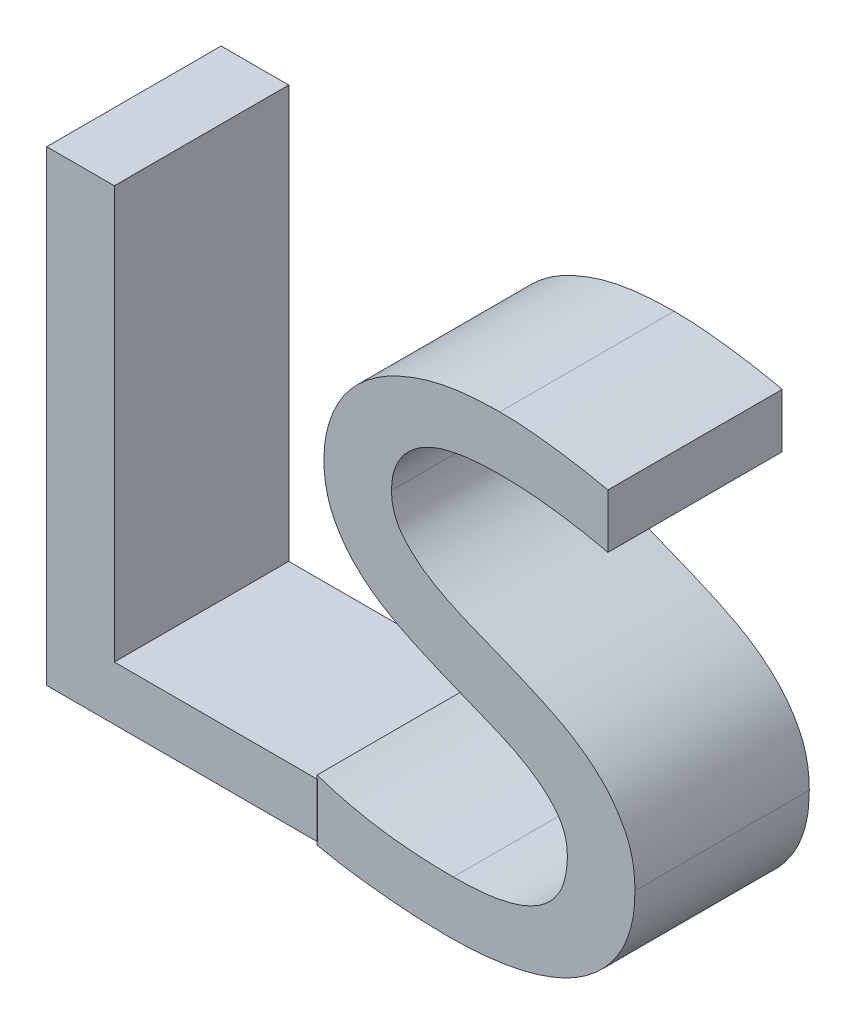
ISO-10303-21;
HEADER;
FILE_DESCRIPTION(('STEP AP214'),'2;1');
FILE_NAME('part.step','',(''),(''),'','','');
FILE_SCHEMA(('AUTOMOTIVE_DESIGN { 1 0 10303 214 1 1 1 1 }'));
ENDSEC;
DATA;
#1=APPLICATION_CONTEXT('core data for automotive mechanical design processes');
#2=APPLICATION_PROTOCOL_DEFINITION('international standard','automotive_design',2000,#1);
#3=PRODUCT_CONTEXT('',#1,'mechanical');
#4=PRODUCT('Part','Part','',(#3));
#5=PRODUCT_RELATED_PRODUCT_CATEGORY('part','',(#4));
#6=PRODUCT_DEFINITION_FORMATION('','',#4);
#7=PRODUCT_DEFINITION_CONTEXT('part definition',#1,'design');
#8=PRODUCT_DEFINITION('design','',#6,#7);
#9=PRODUCT_DEFINITION_SHAPE('','',#8);
#10=(LENGTH_UNIT() NAMED_UNIT(*) SI_UNIT(.MILLI.,.METRE.));
#11=(NAMED_UNIT(*) PLANE_ANGLE_UNIT() SI_UNIT($,.RADIAN.));
#12=(NAMED_UNIT(*) SI_UNIT($,.STERADIAN.) SOLID_ANGLE_UNIT());
#13=UNCERTAINTY_MEASURE_WITH_UNIT(LENGTH_MEASURE(1.E-05),#10,'distance_accuracy_value','');
#14=(GEOMETRIC_REPRESENTATION_CONTEXT(3) GLOBAL_UNCERTAINTY_ASSIGNED_CONTEXT((#13)) GLOBAL_UNIT_ASSIGNED_CONTEXT((#10,
#11,#12)) REPRESENTATION_CONTEXT('',''));
#15=CARTESIAN_POINT('',(0.,0.,0.));
#16=DIRECTION('',(0.,0.,1.));
#17=DIRECTION('',(1.,0.,0.));
#18=AXIS2_PLACEMENT_3D('',#15,#16,#17);
#19=CARTESIAN_POINT('',(40.3188405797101,6.20289855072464,20.));
#20=DIRECTION('',(1.,0.,0.));
#21=DIRECTION('',(0.,0.,-1.));
#22=AXIS2_PLACEMENT_3D('',#19,#20,#21);
#23=PLANE('',#22);
#24=DIRECTION('',(0.,0.,-1.));
#25=VECTOR('',#24,1.);
#26=CARTESIAN_POINT('',(40.3188405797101,0.,20.));
#27=LINE('',#26,#25);
#28=CARTESIAN_POINT('',(40.3188405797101,0.,20.));
#29=VERTEX_POINT('',#28);
#30=CARTESIAN_POINT('',(40.3188405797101,0.,19.9800932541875));
#31=VERTEX_POINT('',#30);
#32=EDGE_CURVE('E84',#29,#31,#27,.T.);
#33=ORIENTED_EDGE('',*,*,#32,.T.);
#34=DIRECTION('',(0.,1.,0.));
#35=VECTOR('',#34,1.);
#36=CARTESIAN_POINT('',(40.3188405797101,6.20289855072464,19.9800932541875));
#37=LINE('',#36,#35);
#38=CARTESIAN_POINT('',(40.3188405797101,6.20289855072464,19.9800932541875));
#39=VERTEX_POINT('',#38);
#40=EDGE_CURVE('E164',#31,#39,#37,.T.);
#41=ORIENTED_EDGE('',*,*,#40,.T.);
#42=DIRECTION('',(0.,0.,-1.));
#43=VECTOR('',#42,1.);
#44=CARTESIAN_POINT('',(40.3188405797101,6.20289855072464,20.));
#45=LINE('',#44,#43);
#46=CARTESIAN_POINT('',(40.3188405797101,6.20289855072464,20.));
#47=VERTEX_POINT('',#46);
#48=EDGE_CURVE('E54',#47,#39,#45,.T.);
#49=ORIENTED_EDGE('',*,*,#48,.F.);
#50=DIRECTION('',(0.,-1.,0.));
#51=VECTOR('',#50,1.);
#52=CARTESIAN_POINT('',(40.3188405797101,6.20289855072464,20.));
#53=LINE('',#52,#51);
#54=EDGE_CURVE('E135',#47,#29,#53,.T.);
#55=ORIENTED_EDGE('',*,*,#54,.T.);
#56=EDGE_LOOP('',(#33,#41,#49,#55));
#57=FACE_BOUND('',#56,.T.);
#58=ADVANCED_FACE('F31',(#57),#23,.T.);
#59=CARTESIAN_POINT('',(17.0579710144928,6.20289855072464,20.));
#60=DIRECTION('',(0.,1.,0.));
#61=DIRECTION('',(0.,0.,1.));
#62=AXIS2_PLACEMENT_3D('',#59,#60,#61);
#63=PLANE('',#62);
#64=DIRECTION('',(-1.,0.,0.));
#65=VECTOR('',#64,1.);
#66=CARTESIAN_POINT('',(17.0579710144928,6.20289855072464,19.9800932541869));
#67=LINE('',#66,#65);
#68=CARTESIAN_POINT('',(40.2934279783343,6.20289855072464,19.9800932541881));
#69=VERTEX_POINT('',#68);
#70=EDGE_CURVE('E126',#39,#69,#67,.T.);
#71=ORIENTED_EDGE('',*,*,#70,.T.);
#72=DIRECTION('',(0.,0.,-1.));
#73=VECTOR('',#72,1.);
#74=CARTESIAN_POINT('',(40.2934279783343,6.20289855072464,20.));
#75=LINE('',#74,#73);
#76=CARTESIAN_POINT('',(40.2934279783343,6.20289855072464,0.));
#77=VERTEX_POINT('',#76);
#78=EDGE_CURVE('E157',#69,#77,#75,.T.);
#79=ORIENTED_EDGE('',*,*,#78,.T.);
#80=DIRECTION('',(1.,0.,0.));
#81=VECTOR('',#80,1.);
#82=CARTESIAN_POINT('',(17.0579710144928,6.20289855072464,0.));
#83=LINE('',#82,#81);
#84=CARTESIAN_POINT('',(17.0579710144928,6.20289855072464,0.));
#85=VERTEX_POINT('',#84);
#86=EDGE_CURVE('E132',#85,#77,#83,.T.);
#87=ORIENTED_EDGE('',*,*,#86,.F.);
#88=DIRECTION('',(0.,0.,-1.));
#89=VECTOR('',#88,1.);
#90=CARTESIAN_POINT('',(17.0579710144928,6.20289855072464,20.));
#91=LINE('',#90,#89);
#92=CARTESIAN_POINT('',(17.0579710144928,6.20289855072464,20.));
#93=VERTEX_POINT('',#92);
#94=EDGE_CURVE('E76',#93,#85,#91,.T.);
#95=ORIENTED_EDGE('',*,*,#94,.F.);
#96=DIRECTION('',(1.,0.,0.));
#97=VECTOR('',#96,1.);
#98=CARTESIAN_POINT('',(17.0579710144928,6.20289855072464,20.));
#99=LINE('',#98,#97);
#100=EDGE_CURVE('E113',#93,#47,#99,.T.);
#101=ORIENTED_EDGE('',*,*,#100,.T.);
#102=ORIENTED_EDGE('',*,*,#48,.T.);
#103=EDGE_LOOP('',(#71,#79,#87,#95,#101,#102));
#104=FACE_BOUND('',#103,.T.);
#105=ADVANCED_FACE('F156',(#104),#63,.T.);
#106=CARTESIAN_POINT('',(40.3188405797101,0.,20.));
#107=DIRECTION('',(0.,-1.,0.));
#108=DIRECTION('',(0.,0.,-1.));
#109=AXIS2_PLACEMENT_3D('',#106,#107,#108);
#110=PLANE('',#109);
#111=DIRECTION('',(-1.,0.,0.));
#112=VECTOR('',#111,1.);
#113=CARTESIAN_POINT('',(40.3188405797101,0.,0.));
#114=LINE('',#113,#112);
#115=CARTESIAN_POINT('',(40.2934279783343,0.,0.));
#116=VERTEX_POINT('',#115);
#117=CARTESIAN_POINT('',(9.30434782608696,0.,0.));
#118=VERTEX_POINT('',#117);
#119=EDGE_CURVE('E123',#116,#118,#114,.T.);
#120=ORIENTED_EDGE('',*,*,#119,.F.);
#121=DIRECTION('',(0.,0.,1.));
#122=VECTOR('',#121,1.);
#123=CARTESIAN_POINT('',(40.2934279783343,0.,20.));
#124=LINE('',#123,#122);
#125=CARTESIAN_POINT('',(40.2934279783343,0.,19.9800932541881));
#126=VERTEX_POINT('',#125);
#127=EDGE_CURVE('E45',#116,#126,#124,.T.);
#128=ORIENTED_EDGE('',*,*,#127,.T.);
#129=DIRECTION('',(1.,0.,0.));
#130=VECTOR('',#129,1.);
#131=CARTESIAN_POINT('',(40.3188405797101,0.,19.9800932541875));
#132=LINE('',#131,#130);
#133=EDGE_CURVE('E11',#126,#31,#132,.T.);
#134=ORIENTED_EDGE('',*,*,#133,.T.);
#135=ORIENTED_EDGE('',*,*,#32,.F.);
#136=DIRECTION('',(-1.,0.,0.));
#137=VECTOR('',#136,1.);
#138=CARTESIAN_POINT('',(40.3188405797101,0.,20.));
#139=LINE('',#138,#137);
#140=CARTESIAN_POINT('',(9.30434782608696,0.,20.));
#141=VERTEX_POINT('',#140);
#142=EDGE_CURVE('E118',#29,#141,#139,.T.);
#143=ORIENTED_EDGE('',*,*,#142,.T.);
#144=DIRECTION('',(0.,0.,-1.));
#145=VECTOR('',#144,1.);
#146=CARTESIAN_POINT('',(9.30434782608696,0.,20.));
#147=LINE('',#146,#145);
#148=EDGE_CURVE('E139',#141,#118,#147,.T.);
#149=ORIENTED_EDGE('',*,*,#148,.T.);
#150=EDGE_LOOP('',(#120,#128,#134,#135,#143,#149));
#151=FACE_BOUND('',#150,.T.);
#152=ADVANCED_FACE('F149',(#151),#110,.T.);
#153=CARTESIAN_POINT('',(40.3188405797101,0.,0.));
#154=DIRECTION('',(0.,0.,-1.));
#155=DIRECTION('',(-1.,0.,0.));
#156=AXIS2_PLACEMENT_3D('',#153,#154,#155);
#157=PLANE('',#156);
#158=ORIENTED_EDGE('',*,*,#86,.T.);
#159=DIRECTION('',(0.,-1.,0.));
#160=VECTOR('',#159,1.);
#161=CARTESIAN_POINT('',(40.2934279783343,0.,0.));
#162=LINE('',#161,#160);
#163=EDGE_CURVE('E38',#77,#116,#162,.T.);
#164=ORIENTED_EDGE('',*,*,#163,.T.);
#165=ORIENTED_EDGE('',*,*,#119,.T.);
#166=DIRECTION('',(0.,1.,0.));
#167=VECTOR('',#166,1.);
#168=CARTESIAN_POINT('',(9.30434782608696,0.,0.));
#169=LINE('',#168,#167);
#170=CARTESIAN_POINT('',(9.30434782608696,53.5,0.));
#171=VERTEX_POINT('',#170);
#172=EDGE_CURVE('E125',#118,#171,#169,.T.);
#173=ORIENTED_EDGE('',*,*,#172,.T.);
#174=DIRECTION('',(1.,0.,0.));
#175=VECTOR('',#174,1.);
#176=CARTESIAN_POINT('',(9.30434782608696,53.5,0.));
#177=LINE('',#176,#175);
#178=CARTESIAN_POINT('',(17.0579710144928,53.5,0.));
#179=VERTEX_POINT('',#178);
#180=EDGE_CURVE('E129',#171,#179,#177,.T.);
#181=ORIENTED_EDGE('',*,*,#180,.T.);
#182=DIRECTION('',(0.,-1.,0.));
#183=VECTOR('',#182,1.);
#184=CARTESIAN_POINT('',(17.0579710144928,53.5,0.));
#185=LINE('',#184,#183);
#186=EDGE_CURVE('E99',#179,#85,#185,.T.);
#187=ORIENTED_EDGE('',*,*,#186,.T.);
#188=EDGE_LOOP('',(#158,#164,#165,#173,#181,#187));
#189=FACE_BOUND('',#188,.T.);
#190=ADVANCED_FACE('F144',(#189),#157,.T.);
#191=CARTESIAN_POINT('',(17.0579710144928,53.5,20.));
#192=DIRECTION('',(1.,0.,0.));
#193=DIRECTION('',(0.,0.,-1.));
#194=AXIS2_PLACEMENT_3D('',#191,#192,#193);
#195=PLANE('',#194);
#196=ORIENTED_EDGE('',*,*,#186,.F.);
#197=DIRECTION('',(0.,0.,-1.));
#198=VECTOR('',#197,1.);
#199=CARTESIAN_POINT('',(17.0579710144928,53.5,20.));
#200=LINE('',#199,#198);
#201=CARTESIAN_POINT('',(17.0579710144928,53.5,20.));
#202=VERTEX_POINT('',#201);
#203=EDGE_CURVE('E94',#202,#179,#200,.T.);
#204=ORIENTED_EDGE('',*,*,#203,.F.);
#205=DIRECTION('',(0.,-1.,0.));
#206=VECTOR('',#205,1.);
#207=CARTESIAN_POINT('',(17.0579710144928,53.5,20.));
#208=LINE('',#207,#206);
#209=EDGE_CURVE('E97',#202,#93,#208,.T.);
#210=ORIENTED_EDGE('',*,*,#209,.T.);
#211=ORIENTED_EDGE('',*,*,#94,.T.);
#212=EDGE_LOOP('',(#196,#204,#210,#211));
#213=FACE_BOUND('',#212,.T.);
#214=ADVANCED_FACE('F96',(#213),#195,.T.);
#215=CARTESIAN_POINT('',(9.30434782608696,53.5,20.));
#216=DIRECTION('',(0.,1.,0.));
#217=DIRECTION('',(0.,0.,1.));
#218=AXIS2_PLACEMENT_3D('',#215,#216,#217);
#219=PLANE('',#218);
#220=ORIENTED_EDGE('',*,*,#180,.F.);
#221=DIRECTION('',(0.,0.,-1.));
#222=VECTOR('',#221,1.);
#223=CARTESIAN_POINT('',(9.30434782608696,53.5,20.));
#224=LINE('',#223,#222);
#225=CARTESIAN_POINT('',(9.30434782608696,53.5,20.));
#226=VERTEX_POINT('',#225);
#227=EDGE_CURVE('E104',#226,#171,#224,.T.);
#228=ORIENTED_EDGE('',*,*,#227,.F.);
#229=DIRECTION('',(1.,0.,0.));
#230=VECTOR('',#229,1.);
#231=CARTESIAN_POINT('',(9.30434782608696,53.5,20.));
#232=LINE('',#231,#230);
#233=EDGE_CURVE('E110',#226,#202,#232,.T.);
#234=ORIENTED_EDGE('',*,*,#233,.T.);
#235=ORIENTED_EDGE('',*,*,#203,.T.);
#236=EDGE_LOOP('',(#220,#228,#234,#235));
#237=FACE_BOUND('',#236,.T.);
#238=ADVANCED_FACE('F115',(#237),#219,.T.);
#239=CARTESIAN_POINT('',(9.30434782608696,0.,20.));
#240=DIRECTION('',(-1.,0.,0.));
#241=DIRECTION('',(0.,0.,1.));
#242=AXIS2_PLACEMENT_3D('',#239,#240,#241);
#243=PLANE('',#242);
#244=ORIENTED_EDGE('',*,*,#172,.F.);
#245=ORIENTED_EDGE('',*,*,#148,.F.);
#246=DIRECTION('',(0.,1.,0.));
#247=VECTOR('',#246,1.);
#248=CARTESIAN_POINT('',(9.30434782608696,0.,20.));
#249=LINE('',#248,#247);
#250=EDGE_CURVE('E116',#141,#226,#249,.T.);
#251=ORIENTED_EDGE('',*,*,#250,.T.);
#252=ORIENTED_EDGE('',*,*,#227,.T.);
#253=EDGE_LOOP('',(#244,#245,#251,#252));
#254=FACE_BOUND('',#253,.T.);
#255=ADVANCED_FACE('F153',(#254),#243,.T.);
#256=CARTESIAN_POINT('',(40.3188405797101,0.,20.));
#257=DIRECTION('',(0.,0.,-1.));
#258=DIRECTION('',(-1.,0.,0.));
#259=AXIS2_PLACEMENT_3D('',#256,#257,#258);
#260=PLANE('',#259);
#261=ORIENTED_EDGE('',*,*,#54,.F.);
#262=ORIENTED_EDGE('',*,*,#100,.F.);
#263=ORIENTED_EDGE('',*,*,#209,.F.);
#264=ORIENTED_EDGE('',*,*,#233,.F.);
#265=ORIENTED_EDGE('',*,*,#250,.F.);
#266=ORIENTED_EDGE('',*,*,#142,.F.);
#267=EDGE_LOOP('',(#261,#262,#263,#264,#265,#266));
#268=FACE_BOUND('',#267,.T.);
#269=ADVANCED_FACE('F108',(#268),#260,.F.);
#270=CARTESIAN_POINT('',(48.8224134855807,39.1060716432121,-0.00749367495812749));
#271=CARTESIAN_POINT('',(48.8344297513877,38.7573430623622,-0.00749367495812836));
#272=CARTESIAN_POINT('',(48.8579070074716,38.0760007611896,-0.00749367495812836));
#273=CARTESIAN_POINT('',(49.099063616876,37.0943038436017,-0.00749367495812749));
#274=CARTESIAN_POINT('',(49.4764245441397,36.1852005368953,-0.00749367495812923));
#275=CARTESIAN_POINT('',(50.0040261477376,35.3514538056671,-0.00749367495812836));
#276=CARTESIAN_POINT('',(50.6761144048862,34.6083735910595,-0.00749367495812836));
#277=CARTESIAN_POINT('',(51.4158390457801,33.8855549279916,-0.00749367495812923));
#278=CARTESIAN_POINT('',(52.2574180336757,33.2074435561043,-0.00749367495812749));
#279=CARTESIAN_POINT('',(53.5273829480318,32.3392006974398,-0.00749367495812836));
#280=CARTESIAN_POINT('',(55.3236155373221,31.3497533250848,-0.00749367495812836));
#281=CARTESIAN_POINT('',(57.6838482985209,30.3116396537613,-0.00749367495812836));
#282=CARTESIAN_POINT('',(60.2130072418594,29.3414145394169,-0.00749367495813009));
#283=CARTESIAN_POINT('',(62.7881950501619,28.289567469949,-0.00749367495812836));
#284=CARTESIAN_POINT('',(65.3780843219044,27.1953736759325,-0.00749367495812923));
#285=CARTESIAN_POINT('',(67.4888458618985,26.1774609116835,-0.00749367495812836));
#286=CARTESIAN_POINT('',(69.1270101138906,25.3036658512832,-0.00749367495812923));
#287=CARTESIAN_POINT('',(70.2750187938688,24.5711610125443,-0.00749367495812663));
#288=CARTESIAN_POINT('',(71.3650567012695,23.7986068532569,-0.00749367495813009));
#289=CARTESIAN_POINT('',(72.3673477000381,22.9451014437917,-0.00749367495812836));
#290=CARTESIAN_POINT('',(73.3079295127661,22.04238535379,-0.00749367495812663));
#291=CARTESIAN_POINT('',(74.1487341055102,21.0501347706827,-0.00749367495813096));
#292=CARTESIAN_POINT('',(74.8987643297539,19.9899574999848,-0.00749367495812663));
#293=CARTESIAN_POINT('',(75.5454811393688,18.8511883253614,-0.00749367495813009));
#294=CARTESIAN_POINT('',(76.0986390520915,17.6315132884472,-0.00749367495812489));
#295=CARTESIAN_POINT('',(76.4593563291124,16.2896410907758,-0.00749367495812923));
#296=CARTESIAN_POINT('',(76.7021185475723,14.8444382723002,-0.00749367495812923));
#297=CARTESIAN_POINT('',(76.7240892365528,13.843278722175,-0.00749367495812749));
#298=CARTESIAN_POINT('',(76.7354569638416,13.3252745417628,-0.00749367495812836));
#299=B_SPLINE_CURVE_WITH_KNOTS('',3,(#270,#271,#272,#273,#274,#275,#276,#277,#278,#279,#280,
#281,#282,#283,#284,#285,#286,#287,#288,#289,#290,#291,#292,#293,#294,#295,#296,#297,#298),
.UNSPECIFIED.,.F.,.F.,(4,1,1,1,1,1,1,1,1,1,1,1,1,1,1,1,1,1,1,1,1,1,1,1,1,1,4),(0.,
0.0256725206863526,0.0501587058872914,0.0740509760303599,0.0980099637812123,0.12249433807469,
0.147766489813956,0.174229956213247,0.20206690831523,0.261130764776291,0.325111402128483,
0.392078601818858,0.460871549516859,0.530238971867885,0.599364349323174,0.6336119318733,
0.667072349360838,0.699717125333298,0.732050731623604,0.764060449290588,0.795747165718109,
0.827803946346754,0.859680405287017,0.892214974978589,0.92624826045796,0.961840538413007,1.),.UNSPECIFIED.);
#300=DIRECTION('',(0.,0.,1.));
#301=VECTOR('',#300,1.);
#302=SURFACE_OF_LINEAR_EXTRUSION('',#299,#301);
#303=DIRECTION('',(0.,0.,1.));
#304=VECTOR('',#303,1.);
#305=CARTESIAN_POINT('',(48.8224134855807,39.1060716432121,-0.00749367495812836));
#306=LINE('',#305,#304);
#307=CARTESIAN_POINT('',(48.8224134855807,39.1060716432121,-0.00749367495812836));
#308=VERTEX_POINT('',#307);
#309=CARTESIAN_POINT('',(48.8224134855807,39.1060716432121,19.9800932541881));
#310=VERTEX_POINT('',#309);
#311=EDGE_CURVE('E273',#308,#310,#306,.T.);
#312=ORIENTED_EDGE('',*,*,#311,.T.);
#313=CARTESIAN_POINT('',(48.8224134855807,39.1060716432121,19.9800932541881));
#314=CARTESIAN_POINT('',(48.8344297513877,38.7573430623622,19.9800932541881));
#315=CARTESIAN_POINT('',(48.8579070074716,38.0760007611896,19.9800932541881));
#316=CARTESIAN_POINT('',(49.099063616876,37.0943038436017,19.9800932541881));
#317=CARTESIAN_POINT('',(49.4764245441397,36.1852005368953,19.9800932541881));
#318=CARTESIAN_POINT('',(50.0040261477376,35.3514538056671,19.9800932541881));
#319=CARTESIAN_POINT('',(50.6761144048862,34.6083735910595,19.9800932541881));
#320=CARTESIAN_POINT('',(51.4158390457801,33.8855549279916,19.9800932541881));
#321=CARTESIAN_POINT('',(52.2574180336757,33.2074435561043,19.9800932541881));
#322=CARTESIAN_POINT('',(53.5273829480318,32.3392006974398,19.9800932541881));
#323=CARTESIAN_POINT('',(55.3236155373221,31.3497533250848,19.9800932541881));
#324=CARTESIAN_POINT('',(57.6838482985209,30.3116396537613,19.9800932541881));
#325=CARTESIAN_POINT('',(60.2130072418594,29.3414145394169,19.9800932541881));
#326=CARTESIAN_POINT('',(62.7881950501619,28.289567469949,19.9800932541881));
#327=CARTESIAN_POINT('',(65.3780843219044,27.1953736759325,19.9800932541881));
#328=CARTESIAN_POINT('',(67.4888458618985,26.1774609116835,19.9800932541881));
#329=CARTESIAN_POINT('',(69.1270101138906,25.3036658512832,19.9800932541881));
#330=CARTESIAN_POINT('',(70.2750187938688,24.5711610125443,19.9800932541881));
#331=CARTESIAN_POINT('',(71.3650567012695,23.7986068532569,19.9800932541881));
#332=CARTESIAN_POINT('',(72.3673477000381,22.9451014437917,19.9800932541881));
#333=CARTESIAN_POINT('',(73.3079295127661,22.04238535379,19.9800932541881));
#334=CARTESIAN_POINT('',(74.1487341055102,21.0501347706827,19.9800932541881));
#335=CARTESIAN_POINT('',(74.8987643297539,19.9899574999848,19.9800932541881));
#336=CARTESIAN_POINT('',(75.5454811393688,18.8511883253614,19.9800932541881));
#337=CARTESIAN_POINT('',(76.0986390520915,17.6315132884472,19.9800932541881));
#338=CARTESIAN_POINT('',(76.4593563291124,16.2896410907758,19.9800932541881));
#339=CARTESIAN_POINT('',(76.7021185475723,14.8444382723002,19.9800932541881));
#340=CARTESIAN_POINT('',(76.7240892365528,13.843278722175,19.9800932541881));
#341=CARTESIAN_POINT('',(76.7354569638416,13.3252745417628,19.9800932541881));
#342=B_SPLINE_CURVE_WITH_KNOTS('',3,(#313,#314,#315,#316,#317,#318,#319,#320,#321,#322,#323,
#324,#325,#326,#327,#328,#329,#330,#331,#332,#333,#334,#335,#336,#337,#338,#339,#340,#341),
.UNSPECIFIED.,.F.,.F.,(4,1,1,1,1,1,1,1,1,1,1,1,1,1,1,1,1,1,1,1,1,1,1,1,1,1,4),(0.,
0.0256725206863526,0.0501587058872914,0.0740509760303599,0.0980099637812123,0.12249433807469,
0.147766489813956,0.174229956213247,0.20206690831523,0.261130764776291,0.325111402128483,
0.392078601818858,0.460871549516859,0.530238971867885,0.599364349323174,0.6336119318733,
0.667072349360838,0.699717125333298,0.732050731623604,0.764060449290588,0.795747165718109,
0.827803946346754,0.859680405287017,0.892214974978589,0.92624826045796,0.961840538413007,1.),.UNSPECIFIED.);
#343=CARTESIAN_POINT('',(76.7354569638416,13.3252745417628,19.9800932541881));
#344=VERTEX_POINT('',#343);
#345=EDGE_CURVE('E265',#310,#344,#342,.T.);
#346=ORIENTED_EDGE('',*,*,#345,.T.);
#347=DIRECTION('',(0.,0.,1.));
#348=VECTOR('',#347,1.);
#349=CARTESIAN_POINT('',(76.7354569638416,13.3252745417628,-0.00749367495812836));
#350=LINE('',#349,#348);
#351=CARTESIAN_POINT('',(76.7354569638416,13.3252745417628,-0.00749367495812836));
#352=VERTEX_POINT('',#351);
#353=EDGE_CURVE('E167',#352,#344,#350,.T.);
#354=ORIENTED_EDGE('',*,*,#353,.F.);
#355=EDGE_CURVE('E350',#308,#352,#299,.T.);
#356=ORIENTED_EDGE('',*,*,#355,.F.);
#357=EDGE_LOOP('',(#312,#346,#354,#356));
#358=FACE_BOUND('',#357,.T.);
#359=ADVANCED_FACE('F271',(#358),#302,.F.);
#360=CARTESIAN_POINT('',(76.7354569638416,13.3252745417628,-0.00749367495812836));
#361=CARTESIAN_POINT('',(76.7180460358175,12.7062253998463,-0.00749367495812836));
#362=CARTESIAN_POINT('',(76.6842691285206,11.50528048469,-0.00749367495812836));
#363=CARTESIAN_POINT('',(76.3870909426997,9.75776684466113,-0.00749367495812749));
#364=CARTESIAN_POINT('',(75.8914915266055,8.13459153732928,-0.00749367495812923));
#365=CARTESIAN_POINT('',(75.2104589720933,6.62464359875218,-0.00749367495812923));
#366=CARTESIAN_POINT('',(74.3343588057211,5.2553460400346,-0.00749367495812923));
#367=CARTESIAN_POINT('',(73.3336541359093,3.97728844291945,-0.00749367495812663));
#368=CARTESIAN_POINT('',(72.1387289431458,2.85310351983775,-0.00749367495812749));
#369=CARTESIAN_POINT('',(70.8149515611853,1.82948062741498,-0.00749367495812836));
#370=CARTESIAN_POINT('',(69.3416452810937,0.928621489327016,-0.00749367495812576));
#371=CARTESIAN_POINT('',(67.7150401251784,0.170466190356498,-0.00749367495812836));
#372=CARTESIAN_POINT('',(65.957434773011,-0.484511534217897,-0.00749367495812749));
#373=CARTESIAN_POINT('',(64.0639460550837,-1.0126217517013,-0.00749367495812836));
#374=CARTESIAN_POINT('',(62.0515045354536,-1.42315606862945,-0.00749367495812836));
#375=CARTESIAN_POINT('',(59.9300436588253,-1.70517960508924,-0.00749367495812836));
#376=CARTESIAN_POINT('',(57.7102220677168,-1.89552587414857,-0.00749367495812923));
#377=CARTESIAN_POINT('',(56.1968456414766,-1.91673871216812,-0.00749367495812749));
#378=CARTESIAN_POINT('',(55.4251082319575,-1.92755607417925,-0.00749367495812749));
#379=B_SPLINE_CURVE_WITH_KNOTS('',3,(#360,#361,#362,#363,#364,#365,#366,#367,#368,#369,#370,
#371,#372,#373,#374,#375,#376,#377,#378),.UNSPECIFIED.,.F.,.F.,(4,1,1,1,1,1,1,1,1,1,1,1,1,1,1,1,
4),(0.,0.0628526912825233,0.121933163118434,0.179421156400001,0.234864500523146,
0.289612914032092,0.344199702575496,0.399327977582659,0.455782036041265,0.513968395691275,
0.574342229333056,0.63781840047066,0.704312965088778,0.773826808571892,0.846291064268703,
0.921617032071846,1.),.UNSPECIFIED.);
#380=DIRECTION('',(0.,0.,1.));
#381=VECTOR('',#380,1.);
#382=SURFACE_OF_LINEAR_EXTRUSION('',#379,#381);
#383=ORIENTED_EDGE('',*,*,#353,.T.);
#384=CARTESIAN_POINT('',(76.7354569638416,13.3252745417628,19.9800932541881));
#385=CARTESIAN_POINT('',(76.7180460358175,12.7062253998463,19.9800932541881));
#386=CARTESIAN_POINT('',(76.6842691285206,11.50528048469,19.9800932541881));
#387=CARTESIAN_POINT('',(76.3870909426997,9.75776684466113,19.9800932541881));
#388=CARTESIAN_POINT('',(75.8914915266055,8.13459153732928,19.9800932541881));
#389=CARTESIAN_POINT('',(75.2104589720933,6.62464359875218,19.9800932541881));
#390=CARTESIAN_POINT('',(74.3343588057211,5.2553460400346,19.9800932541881));
#391=CARTESIAN_POINT('',(73.3336541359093,3.97728844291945,19.9800932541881));
#392=CARTESIAN_POINT('',(72.1387289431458,2.85310351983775,19.9800932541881));
#393=CARTESIAN_POINT('',(70.8149515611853,1.82948062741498,19.9800932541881));
#394=CARTESIAN_POINT('',(69.3416452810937,0.928621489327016,19.9800932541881));
#395=CARTESIAN_POINT('',(67.7150401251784,0.170466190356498,19.9800932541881));
#396=CARTESIAN_POINT('',(65.957434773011,-0.484511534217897,19.9800932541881));
#397=CARTESIAN_POINT('',(64.0639460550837,-1.0126217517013,19.9800932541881));
#398=CARTESIAN_POINT('',(62.0515045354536,-1.42315606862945,19.9800932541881));
#399=CARTESIAN_POINT('',(59.9300436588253,-1.70517960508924,19.9800932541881));
#400=CARTESIAN_POINT('',(57.7102220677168,-1.89552587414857,19.9800932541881));
#401=CARTESIAN_POINT('',(56.1968456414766,-1.91673871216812,19.9800932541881));
#402=CARTESIAN_POINT('',(55.4251082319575,-1.92755607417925,19.9800932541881));
#403=B_SPLINE_CURVE_WITH_KNOTS('',3,(#384,#385,#386,#387,#388,#389,#390,#391,#392,#393,#394,
#395,#396,#397,#398,#399,#400,#401,#402),.UNSPECIFIED.,.F.,.F.,(4,1,1,1,1,1,1,1,1,1,1,1,1,1,1,1,
4),(0.,0.0628526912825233,0.121933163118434,0.179421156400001,0.234864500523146,
0.289612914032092,0.344199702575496,0.399327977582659,0.455782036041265,0.513968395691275,
0.574342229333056,0.63781840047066,0.704312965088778,0.773826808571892,0.846291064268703,
0.921617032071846,1.),.UNSPECIFIED.);
#404=CARTESIAN_POINT('',(55.4251082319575,-1.92755607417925,19.9800932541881));
#405=VERTEX_POINT('',#404);
#406=EDGE_CURVE('E254',#344,#405,#403,.T.);
#407=ORIENTED_EDGE('',*,*,#406,.T.);
#408=DIRECTION('',(0.,0.,1.));
#409=VECTOR('',#408,1.);
#410=CARTESIAN_POINT('',(55.4251082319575,-1.92755607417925,-0.00749367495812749));
#411=LINE('',#410,#409);
#412=CARTESIAN_POINT('',(55.4251082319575,-1.92755607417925,-0.00749367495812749));
#413=VERTEX_POINT('',#412);
#414=EDGE_CURVE('E260',#413,#405,#411,.T.);
#415=ORIENTED_EDGE('',*,*,#414,.F.);
#416=EDGE_CURVE('E255',#352,#413,#379,.T.);
#417=ORIENTED_EDGE('',*,*,#416,.F.);
#418=EDGE_LOOP('',(#383,#407,#415,#417));
#419=FACE_BOUND('',#418,.T.);
#420=ADVANCED_FACE('F252',(#419),#382,.F.);
#421=CARTESIAN_POINT('',(55.4251082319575,-1.92755607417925,-0.00749367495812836));
#422=CARTESIAN_POINT('',(54.714262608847,-1.91959140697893,-0.00749367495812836));
#423=CARTESIAN_POINT('',(53.2959748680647,-1.90370020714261,-0.00749367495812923));
#424=CARTESIAN_POINT('',(51.1868647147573,-1.80628017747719,-0.00749367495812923));
#425=CARTESIAN_POINT('',(49.1234748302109,-1.64534576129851,-0.00749367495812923));
#426=CARTESIAN_POINT('',(47.1366384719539,-1.45182321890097,-0.00749367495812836));
#427=CARTESIAN_POINT('',(45.2414133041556,-1.23669769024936,-0.00749367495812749));
#428=CARTESIAN_POINT('',(43.4629069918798,-0.987900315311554,-0.00749367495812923));
#429=CARTESIAN_POINT('',(41.8235532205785,-0.698607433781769,-0.00749367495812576));
#430=CARTESIAN_POINT('',(40.7855981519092,-0.480331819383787,-0.00749367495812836));
#431=CARTESIAN_POINT('',(40.2934279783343,-0.376831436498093,-0.00749367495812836));
#432=B_SPLINE_CURVE_WITH_KNOTS('',3,(#421,#422,#423,#424,#425,#426,#427,#428,#429,#430,#431),
.UNSPECIFIED.,.F.,.F.,(4,1,1,1,1,1,1,1,4),(0.,0.139966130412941,0.279262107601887,
0.415624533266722,0.54743911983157,0.672304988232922,0.791165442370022,0.900976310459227,1.),.UNSPECIFIED.);
#433=DIRECTION('',(0.,0.,1.));
#434=VECTOR('',#433,1.);
#435=SURFACE_OF_LINEAR_EXTRUSION('',#432,#434);
#436=ORIENTED_EDGE('',*,*,#414,.T.);
#437=CARTESIAN_POINT('',(55.4251082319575,-1.92755607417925,19.9800932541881));
#438=CARTESIAN_POINT('',(54.714262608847,-1.91959140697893,19.9800932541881));
#439=CARTESIAN_POINT('',(53.2959748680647,-1.90370020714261,19.9800932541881));
#440=CARTESIAN_POINT('',(51.1868647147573,-1.80628017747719,19.9800932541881));
#441=CARTESIAN_POINT('',(49.1234748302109,-1.64534576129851,19.9800932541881));
#442=CARTESIAN_POINT('',(47.1366384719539,-1.45182321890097,19.9800932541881));
#443=CARTESIAN_POINT('',(45.2414133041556,-1.23669769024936,19.9800932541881));
#444=CARTESIAN_POINT('',(43.4629069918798,-0.987900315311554,19.9800932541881));
#445=CARTESIAN_POINT('',(41.8235532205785,-0.698607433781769,19.9800932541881));
#446=CARTESIAN_POINT('',(40.7855981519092,-0.480331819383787,19.9800932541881));
#447=CARTESIAN_POINT('',(40.2934279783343,-0.376831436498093,19.9800932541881));
#448=B_SPLINE_CURVE_WITH_KNOTS('',3,(#437,#438,#439,#440,#441,#442,#443,#444,#445,#446,#447),
.UNSPECIFIED.,.F.,.F.,(4,1,1,1,1,1,1,1,4),(0.,0.139966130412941,0.279262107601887,
0.415624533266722,0.54743911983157,0.672304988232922,0.791165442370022,0.900976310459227,1.),.UNSPECIFIED.);
#449=CARTESIAN_POINT('',(40.2934279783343,-0.376831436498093,19.9800932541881));
#450=VERTEX_POINT('',#449);
#451=EDGE_CURVE('E269',#405,#450,#448,.T.);
#452=ORIENTED_EDGE('',*,*,#451,.T.);
#453=DIRECTION('',(0.,0.,1.));
#454=VECTOR('',#453,1.);
#455=CARTESIAN_POINT('',(40.2934279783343,-0.376831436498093,-0.00749367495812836));
#456=LINE('',#455,#454);
#457=CARTESIAN_POINT('',(40.2934279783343,-0.376831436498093,-0.00749367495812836));
#458=VERTEX_POINT('',#457);
#459=EDGE_CURVE('E569',#458,#450,#456,.T.);
#460=ORIENTED_EDGE('',*,*,#459,.F.);
#461=EDGE_CURVE('E573',#413,#458,#432,.T.);
#462=ORIENTED_EDGE('',*,*,#461,.F.);
#463=EDGE_LOOP('',(#436,#452,#460,#462));
#464=FACE_BOUND('',#463,.T.);
#465=ADVANCED_FACE('F418',(#464),#435,.F.);
#466=CARTESIAN_POINT('',(40.2934279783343,-0.376831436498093,-0.00749367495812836));
#467=DIRECTION('',(1.,0.,0.));
#468=DIRECTION('',(0.,0.,-1.));
#469=AXIS2_PLACEMENT_3D('',#466,#467,#468);
#470=PLANE('',#469);
#471=ORIENTED_EDGE('',*,*,#78,.F.);
#472=DIRECTION('',(0.,1.,0.));
#473=VECTOR('',#472,1.);
#474=CARTESIAN_POINT('',(40.2934279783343,-0.376831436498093,19.9800932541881));
#475=LINE('',#474,#473);
#476=CARTESIAN_POINT('',(40.2934279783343,6.60142943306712,19.9800932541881));
#477=VERTEX_POINT('',#476);
#478=EDGE_CURVE('E289',#69,#477,#475,.T.);
#479=ORIENTED_EDGE('',*,*,#478,.T.);
#480=DIRECTION('',(0.,0.,1.));
#481=VECTOR('',#480,1.);
#482=CARTESIAN_POINT('',(40.2934279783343,6.60142943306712,-0.00749367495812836));
#483=LINE('',#482,#481);
#484=CARTESIAN_POINT('',(40.2934279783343,6.60142943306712,-0.00749367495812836));
#485=VERTEX_POINT('',#484);
#486=EDGE_CURVE('E566',#485,#477,#483,.T.);
#487=ORIENTED_EDGE('',*,*,#486,.F.);
#488=DIRECTION('',(0.,1.,0.));
#489=VECTOR('',#488,1.);
#490=CARTESIAN_POINT('',(40.2934279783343,-0.376831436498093,-0.00749367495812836));
#491=LINE('',#490,#489);
#492=EDGE_CURVE('E575',#458,#485,#491,.T.);
#493=ORIENTED_EDGE('',*,*,#492,.F.);
#494=ORIENTED_EDGE('',*,*,#459,.T.);
#495=EDGE_CURVE('E290',#450,#126,#475,.T.);
#496=ORIENTED_EDGE('',*,*,#495,.T.);
#497=ORIENTED_EDGE('',*,*,#127,.F.);
#498=ORIENTED_EDGE('',*,*,#163,.F.);
#499=EDGE_LOOP('',(#471,#479,#487,#493,#494,#496,#497,#498));
#500=FACE_BOUND('',#499,.T.);
#501=ADVANCED_FACE('F426',(#500),#470,.F.);
#502=CARTESIAN_POINT('',(40.2934279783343,6.60142943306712,-0.00749367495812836));
#503=CARTESIAN_POINT('',(40.8203590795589,6.42088683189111,-0.00749367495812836));
#504=CARTESIAN_POINT('',(41.8970120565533,6.05199281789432,-0.00749367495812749));
#505=CARTESIAN_POINT('',(43.5858425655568,5.61931363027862,-0.00749367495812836));
#506=CARTESIAN_POINT('',(45.3573704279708,5.21296098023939,-0.00749367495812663));
#507=CARTESIAN_POINT('',(47.2284293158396,4.8734786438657,-0.00749367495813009));
#508=CARTESIAN_POINT('',(49.2172479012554,4.60628942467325,-0.00749367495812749));
#509=CARTESIAN_POINT('',(51.3314141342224,4.41837848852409,-0.00749367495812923));
#510=CARTESIAN_POINT('',(53.5780301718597,4.29112672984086,-0.00749367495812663));
#511=CARTESIAN_POINT('',(55.1180068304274,4.28070189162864,-0.00749367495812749));
#512=CARTESIAN_POINT('',(55.9097096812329,4.27534247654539,-0.00749367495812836));
#513=B_SPLINE_CURVE_WITH_KNOTS('',3,(#502,#503,#504,#505,#506,#507,#508,#509,#510,#511,#512),
.UNSPECIFIED.,.F.,.F.,(4,1,1,1,1,1,1,1,4),(0.,0.10529560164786,0.215145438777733,
0.329457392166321,0.448994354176,0.574605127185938,0.708808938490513,0.850298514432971,1.),.UNSPECIFIED.);
#514=DIRECTION('',(0.,0.,1.));
#515=VECTOR('',#514,1.);
#516=SURFACE_OF_LINEAR_EXTRUSION('',#513,#515);
#517=ORIENTED_EDGE('',*,*,#486,.T.);
#518=CARTESIAN_POINT('',(40.2934279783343,6.60142943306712,19.9800932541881));
#519=CARTESIAN_POINT('',(40.8203590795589,6.42088683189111,19.9800932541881));
#520=CARTESIAN_POINT('',(41.8970120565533,6.05199281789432,19.9800932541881));
#521=CARTESIAN_POINT('',(43.5858425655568,5.61931363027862,19.9800932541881));
#522=CARTESIAN_POINT('',(45.3573704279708,5.21296098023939,19.9800932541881));
#523=CARTESIAN_POINT('',(47.2284293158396,4.8734786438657,19.9800932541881));
#524=CARTESIAN_POINT('',(49.2172479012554,4.60628942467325,19.9800932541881));
#525=CARTESIAN_POINT('',(51.3314141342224,4.41837848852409,19.9800932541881));
#526=CARTESIAN_POINT('',(53.5780301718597,4.29112672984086,19.9800932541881));
#527=CARTESIAN_POINT('',(55.1180068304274,4.28070189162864,19.9800932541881));
#528=CARTESIAN_POINT('',(55.9097096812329,4.27534247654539,19.9800932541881));
#529=B_SPLINE_CURVE_WITH_KNOTS('',3,(#518,#519,#520,#521,#522,#523,#524,#525,#526,#527,#528),
.UNSPECIFIED.,.F.,.F.,(4,1,1,1,1,1,1,1,4),(0.,0.10529560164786,0.215145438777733,
0.329457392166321,0.448994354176,0.574605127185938,0.708808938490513,0.850298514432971,1.),.UNSPECIFIED.);
#530=CARTESIAN_POINT('',(55.9097096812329,4.27534247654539,19.9800932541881));
#531=VERTEX_POINT('',#530);
#532=EDGE_CURVE('E295',#477,#531,#529,.T.);
#533=ORIENTED_EDGE('',*,*,#532,.T.);
#534=DIRECTION('',(0.,0.,1.));
#535=VECTOR('',#534,1.);
#536=CARTESIAN_POINT('',(55.9097096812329,4.27534247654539,-0.00749367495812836));
#537=LINE('',#536,#535);
#538=CARTESIAN_POINT('',(55.9097096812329,4.27534247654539,-0.00749367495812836));
#539=VERTEX_POINT('',#538);
#540=EDGE_CURVE('E564',#539,#531,#537,.T.);
#541=ORIENTED_EDGE('',*,*,#540,.F.);
#542=EDGE_CURVE('E576',#485,#539,#513,.T.);
#543=ORIENTED_EDGE('',*,*,#542,.F.);
#544=EDGE_LOOP('',(#517,#533,#541,#543));
#545=FACE_BOUND('',#544,.T.);
#546=ADVANCED_FACE('F435',(#545),#516,.F.);
#547=CARTESIAN_POINT('',(55.9097096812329,4.27534247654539,-0.00749367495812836));
#548=CARTESIAN_POINT('',(56.4753432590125,4.28116515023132,-0.00749367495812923));
#549=CARTESIAN_POINT('',(57.5633147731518,4.29236480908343,-0.00749367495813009));
#550=CARTESIAN_POINT('',(59.1310263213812,4.40945458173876,-0.00749367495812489));
#551=CARTESIAN_POINT('',(60.570624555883,4.56211003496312,-0.00749367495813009));
#552=CARTESIAN_POINT('',(61.8790082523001,4.82725987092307,-0.00749367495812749));
#553=CARTESIAN_POINT('',(63.06930862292,5.13244951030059,-0.00749367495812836));
#554=CARTESIAN_POINT('',(64.1451901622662,5.52081395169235,-0.00749367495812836));
#555=CARTESIAN_POINT('',(65.1049554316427,5.98299021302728,-0.00749367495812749));
#556=CARTESIAN_POINT('',(65.9653473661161,6.50111059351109,-0.00749367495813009));
#557=CARTESIAN_POINT('',(66.7027220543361,7.09975227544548,-0.00749367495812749));
#558=CARTESIAN_POINT('',(67.3492046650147,7.74490794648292,-0.00749367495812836));
#559=CARTESIAN_POINT('',(67.8680089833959,8.46461025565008,-0.00749367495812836));
#560=CARTESIAN_POINT('',(68.289437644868,9.2417793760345,-0.00749367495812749));
#561=CARTESIAN_POINT('',(68.6009775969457,10.0790435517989,-0.00749367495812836));
#562=CARTESIAN_POINT('',(68.8173225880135,10.9741920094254,-0.00749367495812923));
#563=CARTESIAN_POINT('',(68.9534171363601,11.9238672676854,-0.00749367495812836));
#564=CARTESIAN_POINT('',(68.9721943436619,12.5777085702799,-0.00749367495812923));
#565=CARTESIAN_POINT('',(68.9818337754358,12.9133633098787,-0.00749367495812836));
#566=B_SPLINE_CURVE_WITH_KNOTS('',3,(#547,#548,#549,#550,#551,#552,#553,#554,#555,#556,#557,
#558,#559,#560,#561,#562,#563,#564,#565),.UNSPECIFIED.,.F.,.F.,(4,1,1,1,1,1,1,1,1,1,1,1,1,1,1,1,
4),(0.,0.0951996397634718,0.183112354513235,0.264571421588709,0.338702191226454,
0.407631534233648,0.471290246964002,0.530887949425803,0.586738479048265,0.639931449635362,
0.690409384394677,0.740042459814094,0.788711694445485,0.838840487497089,0.889955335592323,
0.9435076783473,1.),.UNSPECIFIED.);
#567=DIRECTION('',(0.,0.,1.));
#568=VECTOR('',#567,1.);
#569=SURFACE_OF_LINEAR_EXTRUSION('',#566,#568);
#570=ORIENTED_EDGE('',*,*,#540,.T.);
#571=CARTESIAN_POINT('',(55.9097096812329,4.27534247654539,19.9800932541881));
#572=CARTESIAN_POINT('',(56.4753432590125,4.28116515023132,19.9800932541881));
#573=CARTESIAN_POINT('',(57.5633147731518,4.29236480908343,19.9800932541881));
#574=CARTESIAN_POINT('',(59.1310263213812,4.40945458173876,19.9800932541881));
#575=CARTESIAN_POINT('',(60.570624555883,4.56211003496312,19.9800932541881));
#576=CARTESIAN_POINT('',(61.8790082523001,4.82725987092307,19.9800932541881));
#577=CARTESIAN_POINT('',(63.06930862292,5.13244951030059,19.9800932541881));
#578=CARTESIAN_POINT('',(64.1451901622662,5.52081395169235,19.9800932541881));
#579=CARTESIAN_POINT('',(65.1049554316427,5.98299021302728,19.9800932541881));
#580=CARTESIAN_POINT('',(65.9653473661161,6.50111059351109,19.9800932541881));
#581=CARTESIAN_POINT('',(66.7027220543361,7.09975227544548,19.9800932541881));
#582=CARTESIAN_POINT('',(67.3492046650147,7.74490794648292,19.9800932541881));
#583=CARTESIAN_POINT('',(67.8680089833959,8.46461025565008,19.9800932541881));
#584=CARTESIAN_POINT('',(68.289437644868,9.2417793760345,19.9800932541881));
#585=CARTESIAN_POINT('',(68.6009775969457,10.0790435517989,19.9800932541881));
#586=CARTESIAN_POINT('',(68.8173225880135,10.9741920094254,19.9800932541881));
#587=CARTESIAN_POINT('',(68.9534171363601,11.9238672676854,19.9800932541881));
#588=CARTESIAN_POINT('',(68.9721943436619,12.5777085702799,19.9800932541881));
#589=CARTESIAN_POINT('',(68.9818337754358,12.9133633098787,19.9800932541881));
#590=B_SPLINE_CURVE_WITH_KNOTS('',3,(#571,#572,#573,#574,#575,#576,#577,#578,#579,#580,#581,
#582,#583,#584,#585,#586,#587,#588,#589),.UNSPECIFIED.,.F.,.F.,(4,1,1,1,1,1,1,1,1,1,1,1,1,1,1,1,
4),(0.,0.0951996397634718,0.183112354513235,0.264571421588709,0.338702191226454,
0.407631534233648,0.471290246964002,0.530887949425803,0.586738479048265,0.639931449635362,
0.690409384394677,0.740042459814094,0.788711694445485,0.838840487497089,0.889955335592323,
0.9435076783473,1.),.UNSPECIFIED.);
#591=CARTESIAN_POINT('',(68.9818337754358,12.9133633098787,19.9800932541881));
#592=VERTEX_POINT('',#591);
#593=EDGE_CURVE('E300',#531,#592,#590,.T.);
#594=ORIENTED_EDGE('',*,*,#593,.T.);
#595=DIRECTION('',(0.,0.,1.));
#596=VECTOR('',#595,1.);
#597=CARTESIAN_POINT('',(68.9818337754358,12.9133633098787,-0.00749367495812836));
#598=LINE('',#597,#596);
#599=CARTESIAN_POINT('',(68.9818337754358,12.9133633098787,-0.00749367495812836));
#600=VERTEX_POINT('',#599);
#601=EDGE_CURVE('E562',#600,#592,#598,.T.);
#602=ORIENTED_EDGE('',*,*,#601,.F.);
#603=EDGE_CURVE('E589',#539,#600,#566,.T.);
#604=ORIENTED_EDGE('',*,*,#603,.F.);
#605=EDGE_LOOP('',(#570,#594,#602,#604));
#606=FACE_BOUND('',#605,.T.);
#607=ADVANCED_FACE('F444',(#606),#569,.F.);
#608=CARTESIAN_POINT('',(68.9818337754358,12.9133633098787,-0.00749367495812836));
#609=CARTESIAN_POINT('',(68.9698039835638,13.2621259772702,-0.00749367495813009));
#610=CARTESIAN_POINT('',(68.9463003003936,13.943534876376,-0.00749367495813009));
#611=CARTESIAN_POINT('',(68.7062262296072,14.9211180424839,-0.00749367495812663));
#612=CARTESIAN_POINT('',(68.3308721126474,15.8276721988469,-0.00749367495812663));
#613=CARTESIAN_POINT('',(67.7805839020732,16.6361830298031,-0.00749367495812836));
#614=CARTESIAN_POINT('',(67.1339000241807,17.3958476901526,-0.00749367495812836));
#615=CARTESIAN_POINT('',(66.3741938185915,18.0919420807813,-0.00749367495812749));
#616=CARTESIAN_POINT('',(65.5355845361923,18.7650508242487,-0.00749367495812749));
#617=CARTESIAN_POINT('',(64.2631256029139,19.6115150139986,-0.00749367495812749));
#618=CARTESIAN_POINT('',(62.4826025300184,20.6061443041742,-0.00749367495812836));
#619=CARTESIAN_POINT('',(60.1107442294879,21.6007892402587,-0.00749367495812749));
#620=CARTESIAN_POINT('',(57.5955337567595,22.5994729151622,-0.00749367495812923));
#621=CARTESIAN_POINT('',(55.0142518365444,23.6411049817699,-0.00749367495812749));
#622=CARTESIAN_POINT('',(52.4336280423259,24.7468015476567,-0.00749367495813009));
#623=CARTESIAN_POINT('',(49.9019344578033,25.9181689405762,-0.00749367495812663));
#624=CARTESIAN_POINT('',(47.5274955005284,27.2619705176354,-0.00749367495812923));
#625=CARTESIAN_POINT('',(45.7395007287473,28.5953818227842,-0.00749367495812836));
#626=CARTESIAN_POINT('',(44.4902785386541,29.7960754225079,-0.00749367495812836));
#627=CARTESIAN_POINT('',(43.6404148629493,30.7574604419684,-0.00749367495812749));
#628=CARTESIAN_POINT('',(42.9111953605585,31.8072848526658,-0.00749367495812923));
#629=CARTESIAN_POINT('',(42.2375601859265,32.9084195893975,-0.00749367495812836));
#630=CARTESIAN_POINT('',(41.7105348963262,34.125292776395,-0.00749367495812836));
#631=CARTESIAN_POINT('',(41.3448836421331,35.4464696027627,-0.00749367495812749));
#632=CARTESIAN_POINT('',(41.1022246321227,36.8721156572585,-0.00749367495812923));
#633=CARTESIAN_POINT('',(41.0801941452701,37.8571578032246,-0.00749367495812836));
#634=CARTESIAN_POINT('',(41.0687902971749,38.3670544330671,-0.00749367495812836));
#635=B_SPLINE_CURVE_WITH_KNOTS('',3,(#608,#609,#610,#611,#612,#613,#614,#615,#616,#617,#618,
#619,#620,#621,#622,#623,#624,#625,#626,#627,#628,#629,#630,#631,#632,#633,#634),.UNSPECIFIED.,
.F.,.F.,(4,1,1,1,1,1,1,1,1,1,1,1,1,1,1,1,1,1,1,1,1,1,1,1,4),(0.,0.0258256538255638,
0.0504578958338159,0.0742166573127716,0.0982290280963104,0.122663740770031,0.148097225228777,
0.174530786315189,0.202365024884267,0.261373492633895,0.32549269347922,0.392970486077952,
0.462173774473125,0.531954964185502,0.601234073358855,0.669009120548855,0.734016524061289,
0.766008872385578,0.797430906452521,0.829016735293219,0.86071600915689,0.89305015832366,
0.926998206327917,0.962211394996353,1.),.UNSPECIFIED.);
#636=DIRECTION('',(0.,0.,1.));
#637=VECTOR('',#636,1.);
#638=SURFACE_OF_LINEAR_EXTRUSION('',#635,#637);
#639=ORIENTED_EDGE('',*,*,#601,.T.);
#640=CARTESIAN_POINT('',(68.9818337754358,12.9133633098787,19.9800932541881));
#641=CARTESIAN_POINT('',(68.9698039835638,13.2621259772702,19.9800932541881));
#642=CARTESIAN_POINT('',(68.9463003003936,13.943534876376,19.9800932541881));
#643=CARTESIAN_POINT('',(68.7062262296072,14.9211180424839,19.9800932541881));
#644=CARTESIAN_POINT('',(68.3308721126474,15.8276721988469,19.9800932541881));
#645=CARTESIAN_POINT('',(67.7805839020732,16.6361830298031,19.9800932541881));
#646=CARTESIAN_POINT('',(67.1339000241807,17.3958476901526,19.9800932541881));
#647=CARTESIAN_POINT('',(66.3741938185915,18.0919420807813,19.9800932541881));
#648=CARTESIAN_POINT('',(65.5355845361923,18.7650508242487,19.9800932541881));
#649=CARTESIAN_POINT('',(64.2631256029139,19.6115150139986,19.9800932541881));
#650=CARTESIAN_POINT('',(62.4826025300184,20.6061443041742,19.9800932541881));
#651=CARTESIAN_POINT('',(60.1107442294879,21.6007892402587,19.9800932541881));
#652=CARTESIAN_POINT('',(57.5955337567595,22.5994729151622,19.9800932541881));
#653=CARTESIAN_POINT('',(55.0142518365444,23.6411049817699,19.9800932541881));
#654=CARTESIAN_POINT('',(52.4336280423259,24.7468015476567,19.9800932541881));
#655=CARTESIAN_POINT('',(49.9019344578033,25.9181689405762,19.9800932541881));
#656=CARTESIAN_POINT('',(47.5274955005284,27.2619705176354,19.9800932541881));
#657=CARTESIAN_POINT('',(45.7395007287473,28.5953818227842,19.9800932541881));
#658=CARTESIAN_POINT('',(44.4902785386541,29.7960754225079,19.9800932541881));
#659=CARTESIAN_POINT('',(43.6404148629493,30.7574604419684,19.9800932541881));
#660=CARTESIAN_POINT('',(42.9111953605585,31.8072848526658,19.9800932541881));
#661=CARTESIAN_POINT('',(42.2375601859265,32.9084195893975,19.9800932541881));
#662=CARTESIAN_POINT('',(41.7105348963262,34.125292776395,19.9800932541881));
#663=CARTESIAN_POINT('',(41.3448836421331,35.4464696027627,19.9800932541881));
#664=CARTESIAN_POINT('',(41.1022246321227,36.8721156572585,19.9800932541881));
#665=CARTESIAN_POINT('',(41.0801941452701,37.8571578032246,19.9800932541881));
#666=CARTESIAN_POINT('',(41.0687902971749,38.3670544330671,19.9800932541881));
#667=B_SPLINE_CURVE_WITH_KNOTS('',3,(#640,#641,#642,#643,#644,#645,#646,#647,#648,#649,#650,
#651,#652,#653,#654,#655,#656,#657,#658,#659,#660,#661,#662,#663,#664,#665,#666),.UNSPECIFIED.,
.F.,.F.,(4,1,1,1,1,1,1,1,1,1,1,1,1,1,1,1,1,1,1,1,1,1,1,1,4),(0.,0.0258256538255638,
0.0504578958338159,0.0742166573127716,0.0982290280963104,0.122663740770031,0.148097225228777,
0.174530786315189,0.202365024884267,0.261373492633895,0.32549269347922,0.392970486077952,
0.462173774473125,0.531954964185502,0.601234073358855,0.669009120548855,0.734016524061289,
0.766008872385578,0.797430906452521,0.829016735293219,0.86071600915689,0.89305015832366,
0.926998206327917,0.962211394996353,1.),.UNSPECIFIED.);
#668=CARTESIAN_POINT('',(41.0687902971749,38.3670544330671,19.9800932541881));
#669=VERTEX_POINT('',#668);
#670=EDGE_CURVE('E308',#592,#669,#667,.T.);
#671=ORIENTED_EDGE('',*,*,#670,.T.);
#672=DIRECTION('',(0.,0.,1.));
#673=VECTOR('',#672,1.);
#674=CARTESIAN_POINT('',(41.0687902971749,38.3670544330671,-0.00749367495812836));
#675=LINE('',#674,#673);
#676=CARTESIAN_POINT('',(41.0687902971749,38.3670544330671,-0.00749367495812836));
#677=VERTEX_POINT('',#676);
#678=EDGE_CURVE('E560',#677,#669,#675,.T.);
#679=ORIENTED_EDGE('',*,*,#678,.F.);
#680=EDGE_CURVE('E597',#600,#677,#635,.T.);
#681=ORIENTED_EDGE('',*,*,#680,.F.);
#682=EDGE_LOOP('',(#639,#671,#679,#681));
#683=FACE_BOUND('',#682,.T.);
#684=ADVANCED_FACE('F454',(#683),#638,.F.);
#685=CARTESIAN_POINT('',(41.0687902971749,38.3670544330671,-0.00749367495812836));
#686=CARTESIAN_POINT('',(41.08269033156,38.8242664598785,-0.00749367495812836));
#687=CARTESIAN_POINT('',(41.1105245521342,39.7398138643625,-0.00749367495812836));
#688=CARTESIAN_POINT('',(41.340452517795,41.1078579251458,-0.00749367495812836));
#689=CARTESIAN_POINT('',(41.7020707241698,42.4639485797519,-0.00749367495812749));
#690=CARTESIAN_POINT('',(42.2111698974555,43.803153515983,-0.00749367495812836));
#691=CARTESIAN_POINT('',(42.8780253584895,45.0944782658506,-0.00749367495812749));
#692=CARTESIAN_POINT('',(43.6896058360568,46.3324639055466,-0.00749367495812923));
#693=CARTESIAN_POINT('',(44.686472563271,47.4722901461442,-0.00749367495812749));
#694=CARTESIAN_POINT('',(45.8295503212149,48.5470544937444,-0.00749367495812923));
#695=CARTESIAN_POINT('',(47.1519930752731,49.5303894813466,-0.00749367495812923));
#696=CARTESIAN_POINT('',(48.6372724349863,50.4274128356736,-0.00749367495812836));
#697=CARTESIAN_POINT('',(50.3095520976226,51.1972299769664,-0.00749367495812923));
#698=CARTESIAN_POINT('',(52.1368203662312,51.8958190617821,-0.00749367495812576));
#699=CARTESIAN_POINT('',(54.155914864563,52.4503533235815,-0.00749367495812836));
#700=CARTESIAN_POINT('',(56.356824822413,52.8476350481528,-0.00749367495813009));
#701=CARTESIAN_POINT('',(58.7399809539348,53.0718581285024,-0.00749367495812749));
#702=CARTESIAN_POINT('',(60.3877661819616,53.1056728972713,-0.00749367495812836));
#703=CARTESIAN_POINT('',(61.2403256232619,53.1231685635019,-0.00749367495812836));
#704=B_SPLINE_CURVE_WITH_KNOTS('',3,(#685,#686,#687,#688,#689,#690,#691,#692,#693,#694,#695,
#696,#697,#698,#699,#700,#701,#702,#703),.UNSPECIFIED.,.F.,.F.,(4,1,1,1,1,1,1,1,1,1,1,1,1,1,1,1,
4),(0.,0.0490041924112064,0.0981287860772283,0.148340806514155,0.199331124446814,
0.251431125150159,0.303918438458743,0.357653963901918,0.413415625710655,0.471878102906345,
0.534040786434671,0.599131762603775,0.669026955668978,0.743623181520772,0.823298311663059,
0.908575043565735,1.),.UNSPECIFIED.);
#705=DIRECTION('',(0.,0.,1.));
#706=VECTOR('',#705,1.);
#707=SURFACE_OF_LINEAR_EXTRUSION('',#704,#706);
#708=ORIENTED_EDGE('',*,*,#678,.T.);
#709=CARTESIAN_POINT('',(41.0687902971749,38.3670544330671,19.9800932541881));
#710=CARTESIAN_POINT('',(41.08269033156,38.8242664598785,19.9800932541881));
#711=CARTESIAN_POINT('',(41.1105245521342,39.7398138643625,19.9800932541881));
#712=CARTESIAN_POINT('',(41.340452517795,41.1078579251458,19.9800932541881));
#713=CARTESIAN_POINT('',(41.7020707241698,42.4639485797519,19.9800932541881));
#714=CARTESIAN_POINT('',(42.2111698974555,43.803153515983,19.9800932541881));
#715=CARTESIAN_POINT('',(42.8780253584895,45.0944782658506,19.9800932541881));
#716=CARTESIAN_POINT('',(43.6896058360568,46.3324639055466,19.9800932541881));
#717=CARTESIAN_POINT('',(44.686472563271,47.4722901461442,19.9800932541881));
#718=CARTESIAN_POINT('',(45.8295503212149,48.5470544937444,19.9800932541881));
#719=CARTESIAN_POINT('',(47.1519930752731,49.5303894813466,19.9800932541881));
#720=CARTESIAN_POINT('',(48.6372724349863,50.4274128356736,19.9800932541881));
#721=CARTESIAN_POINT('',(50.3095520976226,51.1972299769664,19.9800932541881));
#722=CARTESIAN_POINT('',(52.1368203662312,51.8958190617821,19.9800932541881));
#723=CARTESIAN_POINT('',(54.155914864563,52.4503533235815,19.9800932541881));
#724=CARTESIAN_POINT('',(56.356824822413,52.8476350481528,19.9800932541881));
#725=CARTESIAN_POINT('',(58.7399809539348,53.0718581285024,19.9800932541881));
#726=CARTESIAN_POINT('',(60.3877661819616,53.1056728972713,19.9800932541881));
#727=CARTESIAN_POINT('',(61.2403256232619,53.1231685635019,19.9800932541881));
#728=B_SPLINE_CURVE_WITH_KNOTS('',3,(#709,#710,#711,#712,#713,#714,#715,#716,#717,#718,#719,
#720,#721,#722,#723,#724,#725,#726,#727),.UNSPECIFIED.,.F.,.F.,(4,1,1,1,1,1,1,1,1,1,1,1,1,1,1,1,
4),(0.,0.0490041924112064,0.0981287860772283,0.148340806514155,0.199331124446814,
0.251431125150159,0.303918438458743,0.357653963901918,0.413415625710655,0.471878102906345,
0.534040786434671,0.599131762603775,0.669026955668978,0.743623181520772,0.823298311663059,
0.908575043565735,1.),.UNSPECIFIED.);
#729=CARTESIAN_POINT('',(61.2403256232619,53.1231685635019,19.9800932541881));
#730=VERTEX_POINT('',#729);
#731=EDGE_CURVE('E316',#669,#730,#728,.T.);
#732=ORIENTED_EDGE('',*,*,#731,.T.);
#733=DIRECTION('',(0.,0.,1.));
#734=VECTOR('',#733,1.);
#735=CARTESIAN_POINT('',(61.2403256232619,53.1231685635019,-0.00749367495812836));
#736=LINE('',#735,#734);
#737=CARTESIAN_POINT('',(61.2403256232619,53.1231685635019,-0.00749367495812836));
#738=VERTEX_POINT('',#737);
#739=EDGE_CURVE('E558',#738,#730,#736,.T.);
#740=ORIENTED_EDGE('',*,*,#739,.F.);
#741=EDGE_CURVE('E605',#677,#738,#704,.T.);
#742=ORIENTED_EDGE('',*,*,#741,.F.);
#743=EDGE_LOOP('',(#708,#732,#740,#742));
#744=FACE_BOUND('',#743,.T.);
#745=ADVANCED_FACE('F464',(#744),#707,.F.);
#746=CARTESIAN_POINT('',(61.2403256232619,53.1231685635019,-0.00749367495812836));
#747=CARTESIAN_POINT('',(61.7170305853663,53.1200800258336,-0.00749367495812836));
#748=CARTESIAN_POINT('',(62.7077424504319,53.1136612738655,-0.00749367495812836));
#749=CARTESIAN_POINT('',(64.2342561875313,53.0039238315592,-0.00749367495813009));
#750=CARTESIAN_POINT('',(65.8264304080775,52.8655240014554,-0.00749367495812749));
#751=CARTESIAN_POINT('',(67.4454200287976,52.6672650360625,-0.00749367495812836));
#752=CARTESIAN_POINT('',(69.0617050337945,52.440928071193,-0.00749367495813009));
#753=CARTESIAN_POINT('',(70.6484816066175,52.1740793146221,-0.00749367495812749));
#754=CARTESIAN_POINT('',(72.1717187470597,51.8892709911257,-0.00749367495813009));
#755=CARTESIAN_POINT('',(73.157930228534,51.6755933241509,-0.00749367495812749));
#756=CARTESIAN_POINT('',(73.6340076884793,51.5724439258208,-0.00749367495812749));
#757=B_SPLINE_CURVE_WITH_KNOTS('',3,(#746,#747,#748,#749,#750,#751,#752,#753,#754,#755,#756),
.UNSPECIFIED.,.F.,.F.,(4,1,1,1,1,1,1,1,4),(0.,0.114270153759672,0.23748189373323,
0.366782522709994,0.497449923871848,0.628493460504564,0.758065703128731,0.88321017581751,1.),.UNSPECIFIED.);
#758=DIRECTION('',(0.,0.,1.));
#759=VECTOR('',#758,1.);
#760=SURFACE_OF_LINEAR_EXTRUSION('',#757,#759);
#761=ORIENTED_EDGE('',*,*,#739,.T.);
#762=CARTESIAN_POINT('',(61.2403256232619,53.1231685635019,19.9800932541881));
#763=CARTESIAN_POINT('',(61.7170305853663,53.1200800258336,19.9800932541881));
#764=CARTESIAN_POINT('',(62.7077424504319,53.1136612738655,19.9800932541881));
#765=CARTESIAN_POINT('',(64.2342561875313,53.0039238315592,19.9800932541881));
#766=CARTESIAN_POINT('',(65.8264304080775,52.8655240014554,19.9800932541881));
#767=CARTESIAN_POINT('',(67.4454200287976,52.6672650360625,19.9800932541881));
#768=CARTESIAN_POINT('',(69.0617050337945,52.440928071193,19.9800932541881));
#769=CARTESIAN_POINT('',(70.6484816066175,52.1740793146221,19.9800932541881));
#770=CARTESIAN_POINT('',(72.1717187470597,51.8892709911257,19.9800932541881));
#771=CARTESIAN_POINT('',(73.157930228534,51.6755933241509,19.9800932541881));
#772=CARTESIAN_POINT('',(73.6340076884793,51.5724439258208,19.9800932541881));
#773=B_SPLINE_CURVE_WITH_KNOTS('',3,(#762,#763,#764,#765,#766,#767,#768,#769,#770,#771,#772),
.UNSPECIFIED.,.F.,.F.,(4,1,1,1,1,1,1,1,4),(0.,0.114270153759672,0.23748189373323,
0.366782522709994,0.497449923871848,0.628493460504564,0.758065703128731,0.88321017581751,1.),.UNSPECIFIED.);
#774=CARTESIAN_POINT('',(73.6340076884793,51.5724439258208,19.9800932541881));
#775=VERTEX_POINT('',#774);
#776=EDGE_CURVE('E324',#730,#775,#773,.T.);
#777=ORIENTED_EDGE('',*,*,#776,.T.);
#778=DIRECTION('',(0.,0.,1.));
#779=VECTOR('',#778,1.);
#780=CARTESIAN_POINT('',(73.6340076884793,51.5724439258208,-0.00749367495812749));
#781=LINE('',#780,#779);
#782=CARTESIAN_POINT('',(73.6340076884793,51.5724439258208,-0.00749367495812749));
#783=VERTEX_POINT('',#782);
#784=EDGE_CURVE('E556',#783,#775,#781,.T.);
#785=ORIENTED_EDGE('',*,*,#784,.F.);
#786=EDGE_CURVE('E613',#738,#783,#757,.T.);
#787=ORIENTED_EDGE('',*,*,#786,.F.);
#788=EDGE_LOOP('',(#761,#777,#785,#787));
#789=FACE_BOUND('',#788,.T.);
#790=ADVANCED_FACE('F474',(#789),#760,.F.);
#791=CARTESIAN_POINT('',(73.6340076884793,51.5724439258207,-0.00749367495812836));
#792=DIRECTION('',(-1.,0.,0.));
#793=DIRECTION('',(0.,0.,1.));
#794=AXIS2_PLACEMENT_3D('',#791,#792,#793);
#795=PLANE('',#794);
#796=ORIENTED_EDGE('',*,*,#784,.T.);
#797=DIRECTION('',(0.,-1.,0.));
#798=VECTOR('',#797,1.);
#799=CARTESIAN_POINT('',(73.6340076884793,51.5724439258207,19.9800932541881));
#800=LINE('',#799,#798);
#801=CARTESIAN_POINT('',(73.6340076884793,45.3695453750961,19.9800932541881));
#802=VERTEX_POINT('',#801);
#803=EDGE_CURVE('E332',#775,#802,#800,.T.);
#804=ORIENTED_EDGE('',*,*,#803,.T.);
#805=DIRECTION('',(0.,0.,1.));
#806=VECTOR('',#805,1.);
#807=CARTESIAN_POINT('',(73.6340076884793,45.3695453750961,-0.00749367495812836));
#808=LINE('',#807,#806);
#809=CARTESIAN_POINT('',(73.6340076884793,45.3695453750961,-0.00749367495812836));
#810=VERTEX_POINT('',#809);
#811=EDGE_CURVE('E554',#810,#802,#808,.T.);
#812=ORIENTED_EDGE('',*,*,#811,.F.);
#813=DIRECTION('',(0.,-1.,0.));
#814=VECTOR('',#813,1.);
#815=CARTESIAN_POINT('',(73.6340076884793,51.5724439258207,-0.00749367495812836));
#816=LINE('',#815,#814);
#817=EDGE_CURVE('E617',#783,#810,#816,.T.);
#818=ORIENTED_EDGE('',*,*,#817,.F.);
#819=EDGE_LOOP('',(#796,#804,#812,#818));
#820=FACE_BOUND('',#819,.T.);
#821=ADVANCED_FACE('F484',(#820),#795,.F.);
#822=CARTESIAN_POINT('',(73.6340076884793,45.3695453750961,-0.00749367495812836));
#823=CARTESIAN_POINT('',(72.5743423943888,45.604572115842,-0.00749367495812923));
#824=CARTESIAN_POINT('',(70.4655220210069,46.0722945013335,-0.00749367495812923));
#825=CARTESIAN_POINT('',(67.291744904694,46.5388704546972,-0.00749367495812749));
#826=CARTESIAN_POINT('',(64.1749132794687,46.8656225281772,-0.00749367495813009));
#827=CARTESIAN_POINT('',(62.1174511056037,46.9022719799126,-0.00749367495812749));
#828=CARTESIAN_POINT('',(61.1070602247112,46.9202700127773,-0.00749367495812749));
#829=B_SPLINE_CURVE_WITH_KNOTS('',3,(#822,#823,#824,#825,#826,#827,#828),.UNSPECIFIED.,.F.,.F.,
(4,1,1,1,4),(0.,0.257352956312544,0.512153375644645,0.760425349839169,1.),.UNSPECIFIED.);
#830=DIRECTION('',(0.,0.,1.));
#831=VECTOR('',#830,1.);
#832=SURFACE_OF_LINEAR_EXTRUSION('',#829,#831);
#833=ORIENTED_EDGE('',*,*,#811,.T.);
#834=CARTESIAN_POINT('',(73.6340076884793,45.3695453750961,19.9800932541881));
#835=CARTESIAN_POINT('',(72.5743423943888,45.604572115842,19.9800932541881));
#836=CARTESIAN_POINT('',(70.4655220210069,46.0722945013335,19.9800932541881));
#837=CARTESIAN_POINT('',(67.291744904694,46.5388704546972,19.9800932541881));
#838=CARTESIAN_POINT('',(64.1749132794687,46.8656225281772,19.9800932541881));
#839=CARTESIAN_POINT('',(62.1174511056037,46.9022719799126,19.9800932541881));
#840=CARTESIAN_POINT('',(61.1070602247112,46.9202700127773,19.9800932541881));
#841=B_SPLINE_CURVE_WITH_KNOTS('',3,(#834,#835,#836,#837,#838,#839,#840),.UNSPECIFIED.,.F.,.F.,
(4,1,1,1,4),(0.,0.257352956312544,0.512153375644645,0.760425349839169,1.),.UNSPECIFIED.);
#842=CARTESIAN_POINT('',(61.1070602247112,46.9202700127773,19.9800932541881));
#843=VERTEX_POINT('',#842);
#844=EDGE_CURVE('E338',#802,#843,#841,.T.);
#845=ORIENTED_EDGE('',*,*,#844,.T.);
#846=DIRECTION('',(0.,0.,1.));
#847=VECTOR('',#846,1.);
#848=CARTESIAN_POINT('',(61.1070602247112,46.9202700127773,-0.00749367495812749));
#849=LINE('',#848,#847);
#850=CARTESIAN_POINT('',(61.1070602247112,46.9202700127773,-0.00749367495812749));
#851=VERTEX_POINT('',#850);
#852=EDGE_CURVE('E552',#851,#843,#849,.T.);
#853=ORIENTED_EDGE('',*,*,#852,.F.);
#854=EDGE_CURVE('E543',#810,#851,#829,.T.);
#855=ORIENTED_EDGE('',*,*,#854,.F.);
#856=EDGE_LOOP('',(#833,#845,#853,#855));
#857=FACE_BOUND('',#856,.T.);
#858=ADVANCED_FACE('F494',(#857),#832,.F.);
#859=CARTESIAN_POINT('',(61.1070602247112,46.9202700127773,-0.00749367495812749));
#860=CARTESIAN_POINT('',(60.5981018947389,46.9124904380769,-0.00749367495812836));
#861=CARTESIAN_POINT('',(59.6115412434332,46.8974105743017,-0.00749367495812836));
#862=CARTESIAN_POINT('',(58.1832725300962,46.8046948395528,-0.00749367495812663));
#863=CARTESIAN_POINT('',(56.8608038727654,46.6349150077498,-0.00749367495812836));
#864=CARTESIAN_POINT('',(55.6427916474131,46.4052883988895,-0.00749367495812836));
#865=CARTESIAN_POINT('',(54.5258698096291,46.1211220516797,-0.00749367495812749));
#866=CARTESIAN_POINT('',(53.5134758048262,45.7601010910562,-0.00749367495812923));
#867=CARTESIAN_POINT('',(52.6111871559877,45.3194274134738,-0.00749367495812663));
#868=CARTESIAN_POINT('',(51.8038225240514,44.824302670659,-0.00749367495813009));
#869=CARTESIAN_POINT('',(51.1032355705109,44.2637956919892,-0.00749367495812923));
#870=CARTESIAN_POINT('',(50.4873620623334,43.6687450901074,-0.00749367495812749));
#871=CARTESIAN_POINT('',(49.973174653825,43.0216923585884,-0.00749367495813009));
#872=CARTESIAN_POINT('',(49.558116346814,42.322752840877,-0.00749367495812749));
#873=CARTESIAN_POINT('',(49.2333000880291,41.581219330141,-0.00749367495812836));
#874=CARTESIAN_POINT('',(48.9810404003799,40.800192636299,-0.00749367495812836));
#875=CARTESIAN_POINT('',(48.8530090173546,39.9664149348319,-0.00749367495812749));
#876=CARTESIAN_POINT('',(48.8327664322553,39.397195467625,-0.00749367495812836));
#877=CARTESIAN_POINT('',(48.8224134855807,39.1060716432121,-0.00749367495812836));
#878=B_SPLINE_CURVE_WITH_KNOTS('',3,(#859,#860,#861,#862,#863,#864,#865,#866,#867,#868,#869,
#870,#871,#872,#873,#874,#875,#876,#877),.UNSPECIFIED.,.F.,.F.,(4,1,1,1,1,1,1,1,1,1,1,1,1,1,1,1,
4),(0.,0.0932148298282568,0.180686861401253,0.261964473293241,0.337246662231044,
0.407566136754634,0.47283893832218,0.533701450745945,0.591166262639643,0.645915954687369,
0.697692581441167,0.747706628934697,0.796793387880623,0.846130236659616,0.895721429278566,
0.94666736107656,1.),.UNSPECIFIED.);
#879=DIRECTION('',(0.,0.,1.));
#880=VECTOR('',#879,1.);
#881=SURFACE_OF_LINEAR_EXTRUSION('',#878,#880);
#882=ORIENTED_EDGE('',*,*,#852,.T.);
#883=CARTESIAN_POINT('',(61.1070602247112,46.9202700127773,19.9800932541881));
#884=CARTESIAN_POINT('',(60.5981018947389,46.9124904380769,19.9800932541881));
#885=CARTESIAN_POINT('',(59.6115412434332,46.8974105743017,19.9800932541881));
#886=CARTESIAN_POINT('',(58.1832725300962,46.8046948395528,19.9800932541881));
#887=CARTESIAN_POINT('',(56.8608038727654,46.6349150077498,19.9800932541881));
#888=CARTESIAN_POINT('',(55.6427916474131,46.4052883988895,19.9800932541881));
#889=CARTESIAN_POINT('',(54.5258698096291,46.1211220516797,19.9800932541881));
#890=CARTESIAN_POINT('',(53.5134758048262,45.7601010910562,19.9800932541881));
#891=CARTESIAN_POINT('',(52.6111871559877,45.3194274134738,19.9800932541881));
#892=CARTESIAN_POINT('',(51.8038225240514,44.824302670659,19.9800932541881));
#893=CARTESIAN_POINT('',(51.1032355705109,44.2637956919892,19.9800932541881));
#894=CARTESIAN_POINT('',(50.4873620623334,43.6687450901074,19.9800932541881));
#895=CARTESIAN_POINT('',(49.973174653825,43.0216923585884,19.9800932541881));
#896=CARTESIAN_POINT('',(49.558116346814,42.322752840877,19.9800932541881));
#897=CARTESIAN_POINT('',(49.2333000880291,41.581219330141,19.9800932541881));
#898=CARTESIAN_POINT('',(48.9810404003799,40.800192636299,19.9800932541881));
#899=CARTESIAN_POINT('',(48.8530090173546,39.9664149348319,19.9800932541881));
#900=CARTESIAN_POINT('',(48.8327664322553,39.397195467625,19.9800932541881));
#901=CARTESIAN_POINT('',(48.8224134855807,39.1060716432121,19.9800932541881));
#902=B_SPLINE_CURVE_WITH_KNOTS('',3,(#883,#884,#885,#886,#887,#888,#889,#890,#891,#892,#893,
#894,#895,#896,#897,#898,#899,#900,#901),.UNSPECIFIED.,.F.,.F.,(4,1,1,1,1,1,1,1,1,1,1,1,1,1,1,1,
4),(0.,0.0932148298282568,0.180686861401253,0.261964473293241,0.337246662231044,
0.407566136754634,0.47283893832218,0.533701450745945,0.591166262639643,0.645915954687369,
0.697692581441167,0.747706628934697,0.796793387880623,0.846130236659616,0.895721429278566,
0.94666736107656,1.),.UNSPECIFIED.);
#903=EDGE_CURVE('E343',#843,#310,#902,.T.);
#904=ORIENTED_EDGE('',*,*,#903,.T.);
#905=ORIENTED_EDGE('',*,*,#311,.F.);
#906=EDGE_CURVE('E538',#851,#308,#878,.T.);
#907=ORIENTED_EDGE('',*,*,#906,.F.);
#908=EDGE_LOOP('',(#882,#904,#905,#907));
#909=FACE_BOUND('',#908,.T.);
#910=ADVANCED_FACE('F504',(#909),#881,.F.);
#911=CARTESIAN_POINT('',(64.2457771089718,27.668696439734,-0.00749367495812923));
#912=DIRECTION('',(0.,0.,-1.));
#913=DIRECTION('',(-1.,0.,0.));
#914=AXIS2_PLACEMENT_3D('',#911,#912,#913);
#915=PLANE('',#914);
#916=ORIENTED_EDGE('',*,*,#355,.T.);
#917=ORIENTED_EDGE('',*,*,#416,.T.);
#918=ORIENTED_EDGE('',*,*,#461,.T.);
#919=ORIENTED_EDGE('',*,*,#492,.T.);
#920=ORIENTED_EDGE('',*,*,#542,.T.);
#921=ORIENTED_EDGE('',*,*,#603,.T.);
#922=ORIENTED_EDGE('',*,*,#680,.T.);
#923=ORIENTED_EDGE('',*,*,#741,.T.);
#924=ORIENTED_EDGE('',*,*,#786,.T.);
#925=ORIENTED_EDGE('',*,*,#817,.T.);
#926=ORIENTED_EDGE('',*,*,#854,.T.);
#927=ORIENTED_EDGE('',*,*,#906,.T.);
#928=EDGE_LOOP('',(#916,#917,#918,#919,#920,#921,#922,#923,#924,#925,#926,#927));
#929=FACE_BOUND('',#928,.T.);
#930=ADVANCED_FACE('F514',(#929),#915,.T.);
#931=CARTESIAN_POINT('',(64.2457771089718,27.668696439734,19.9800932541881));
#932=DIRECTION('',(0.,0.,-1.));
#933=DIRECTION('',(-1.,0.,0.));
#934=AXIS2_PLACEMENT_3D('',#931,#932,#933);
#935=PLANE('',#934);
#936=ORIENTED_EDGE('',*,*,#70,.F.);
#937=ORIENTED_EDGE('',*,*,#40,.F.);
#938=ORIENTED_EDGE('',*,*,#133,.F.);
#939=ORIENTED_EDGE('',*,*,#495,.F.);
#940=ORIENTED_EDGE('',*,*,#451,.F.);
#941=ORIENTED_EDGE('',*,*,#406,.F.);
#942=ORIENTED_EDGE('',*,*,#345,.F.);
#943=ORIENTED_EDGE('',*,*,#903,.F.);
#944=ORIENTED_EDGE('',*,*,#844,.F.);
#945=ORIENTED_EDGE('',*,*,#803,.F.);
#946=ORIENTED_EDGE('',*,*,#776,.F.);
#947=ORIENTED_EDGE('',*,*,#731,.F.);
#948=ORIENTED_EDGE('',*,*,#670,.F.);
#949=ORIENTED_EDGE('',*,*,#593,.F.);
#950=ORIENTED_EDGE('',*,*,#532,.F.);
#951=ORIENTED_EDGE('',*,*,#478,.F.);
#952=EDGE_LOOP('',(#936,#937,#938,#939,#940,#941,#942,#943,#944,#945,#946,#947,#948,#949,#950,#951));
#953=FACE_BOUND('',#952,.T.);
#954=ADVANCED_FACE('F263',(#953),#935,.F.);
#955=CLOSED_SHELL('',(#58,#105,#152,#190,#214,#238,#255,#269,#359,#420,#465,#501,#546,#607,#684,
#745,#790,#821,#858,#910,#930,#954));
#956=MANIFOLD_SOLID_BREP('B2',#955);
#957=ADVANCED_BREP_SHAPE_REPRESENTATION('',(#18,#956),#14);
#958=SHAPE_DEFINITION_REPRESENTATION(#9,#957);
ENDSEC;
END-ISO-10303-21;
